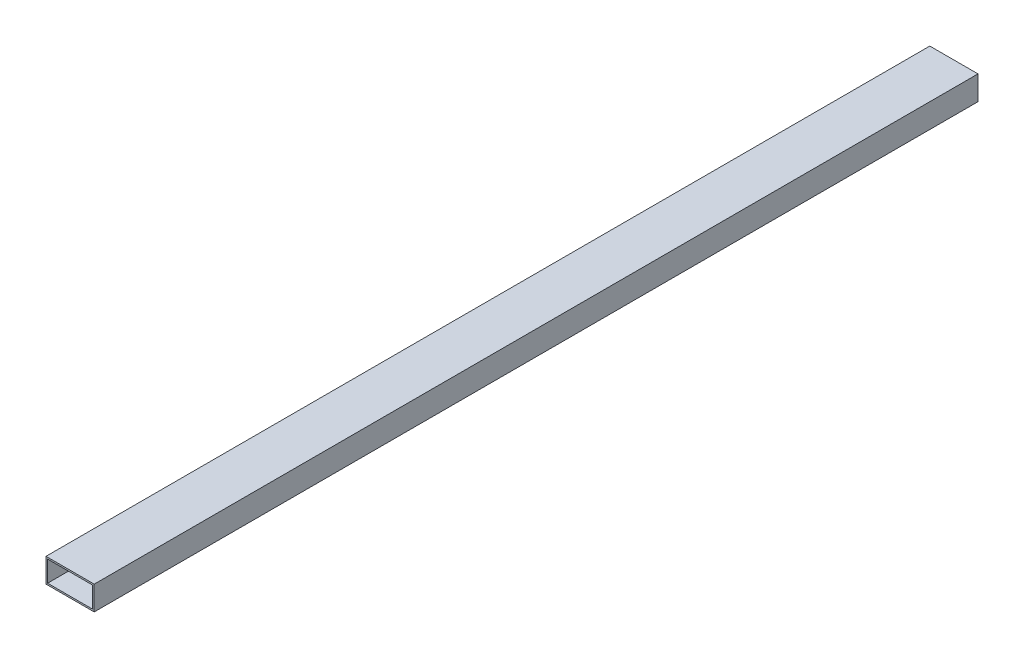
from build123d import *

# Parameters (mm, degrees)
ESQUISSE1_W        = 60
ESQUISSE1_H        = 30
ESQUISSE1_W_2      = 56
ESQUISSE1_H_2      = 26
EXTRU_MINCE1_DEPTH = 1100
ESQUISSE3_R        = 12.5
EXTRUSION2_DEPTH   = 10


with BuildPart() as part:
    # Esquisse1 → Extru.-Mince1 (new body)
    with BuildSketch(Plane.XY):
        Rectangle(ESQUISSE1_W, ESQUISSE1_H)
        Rectangle(ESQUISSE1_W_2, ESQUISSE1_H_2, mode=Mode.SUBTRACT)
    extrude(amount=EXTRU_MINCE1_DEPTH)

    # Esquisse3 → Extrusion2 (cut)
    with BuildSketch(Plane.XZ.offset(15)):
        with Locations((0, 50)):
            Circle(ESQUISSE3_R)
    extrude(amount=-EXTRUSION2_DEPTH, mode=Mode.SUBTRACT)


solid = part.part
